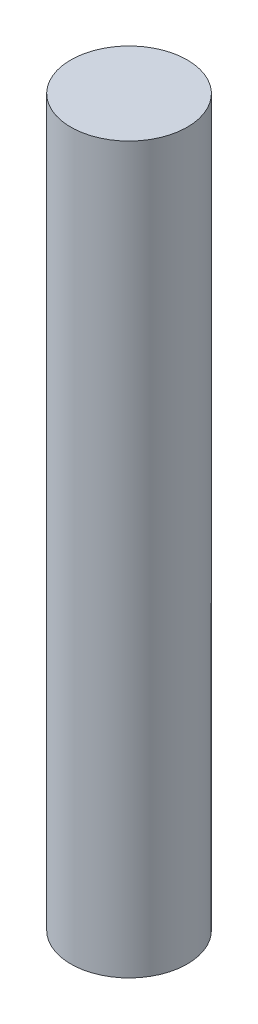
ISO-10303-21;
HEADER;
FILE_DESCRIPTION(('STEP AP214'),'2;1');
FILE_NAME('part.step','',(''),(''),'','','');
FILE_SCHEMA(('AUTOMOTIVE_DESIGN { 1 0 10303 214 1 1 1 1 }'));
ENDSEC;
DATA;
#1=APPLICATION_CONTEXT('core data for automotive mechanical design processes');
#2=APPLICATION_PROTOCOL_DEFINITION('international standard','automotive_design',2000,#1);
#3=PRODUCT_CONTEXT('',#1,'mechanical');
#4=PRODUCT('Part','Part','',(#3));
#5=PRODUCT_RELATED_PRODUCT_CATEGORY('part','',(#4));
#6=PRODUCT_DEFINITION_FORMATION('','',#4);
#7=PRODUCT_DEFINITION_CONTEXT('part definition',#1,'design');
#8=PRODUCT_DEFINITION('design','',#6,#7);
#9=PRODUCT_DEFINITION_SHAPE('','',#8);
#10=(LENGTH_UNIT() NAMED_UNIT(*) SI_UNIT(.MILLI.,.METRE.));
#11=(NAMED_UNIT(*) PLANE_ANGLE_UNIT() SI_UNIT($,.RADIAN.));
#12=(NAMED_UNIT(*) SI_UNIT($,.STERADIAN.) SOLID_ANGLE_UNIT());
#13=UNCERTAINTY_MEASURE_WITH_UNIT(LENGTH_MEASURE(1.E-05),#10,'distance_accuracy_value','');
#14=(GEOMETRIC_REPRESENTATION_CONTEXT(3) GLOBAL_UNCERTAINTY_ASSIGNED_CONTEXT((#13)) GLOBAL_UNIT_ASSIGNED_CONTEXT((#10,
#11,#12)) REPRESENTATION_CONTEXT('',''));
#15=CARTESIAN_POINT('',(0.,0.,0.));
#16=DIRECTION('',(0.,0.,1.));
#17=DIRECTION('',(1.,0.,0.));
#18=AXIS2_PLACEMENT_3D('',#15,#16,#17);
#19=CARTESIAN_POINT('',(0.,-125.082564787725,-139.));
#20=DIRECTION('',(0.,-1.,0.));
#21=DIRECTION('',(0.,0.,-1.));
#22=AXIS2_PLACEMENT_3D('',#19,#20,#21);
#23=PLANE('',#22);
#24=CARTESIAN_POINT('',(0.,-125.082564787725,-139.));
#25=DIRECTION('',(0.,-1.,0.));
#26=DIRECTION('',(0.,0.,-1.));
#27=AXIS2_PLACEMENT_3D('',#24,#25,#26);
#28=CIRCLE('',#27,2.);
#29=CARTESIAN_POINT('',(0.,-125.082564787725,-141.));
#30=VERTEX_POINT('',#29);
#31=EDGE_CURVE('E10',#30,#30,#28,.T.);
#32=ORIENTED_EDGE('',*,*,#31,.F.);
#33=EDGE_LOOP('',(#32));
#34=FACE_BOUND('',#33,.T.);
#35=ADVANCED_FACE('F352',(#34),#23,.F.);
#36=CARTESIAN_POINT('',(0.,-172.219437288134,-139.));
#37=DIRECTION('',(0.,-1.,0.));
#38=DIRECTION('',(0.,0.,-1.));
#39=AXIS2_PLACEMENT_3D('',#36,#37,#38);
#40=CYLINDRICAL_SURFACE('',#39,2.);
#41=CARTESIAN_POINT('',(0.,-149.963329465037,-139.));
#42=DIRECTION('',(0.,-1.,0.));
#43=DIRECTION('',(0.,0.,-1.));
#44=AXIS2_PLACEMENT_3D('',#41,#42,#43);
#45=CIRCLE('',#44,2.);
#46=CARTESIAN_POINT('',(0.,-149.963329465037,-141.));
#47=VERTEX_POINT('',#46);
#48=EDGE_CURVE('E358',#47,#47,#45,.T.);
#49=ORIENTED_EDGE('',*,*,#48,.F.);
#50=EDGE_LOOP('',(#49));
#51=FACE_BOUND('',#50,.T.);
#52=ORIENTED_EDGE('',*,*,#31,.T.);
#53=EDGE_LOOP('',(#52));
#54=FACE_BOUND('',#53,.T.);
#55=ADVANCED_FACE('F366',(#51,#54),#40,.T.);
#56=CARTESIAN_POINT('',(0.,-149.963329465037,-137.));
#57=DIRECTION('',(0.,1.,0.));
#58=DIRECTION('',(0.,0.,1.));
#59=AXIS2_PLACEMENT_3D('',#56,#57,#58);
#60=PLANE('',#59);
#61=ORIENTED_EDGE('',*,*,#48,.T.);
#62=EDGE_LOOP('',(#61));
#63=FACE_BOUND('',#62,.T.);
#64=ADVANCED_FACE('F364',(#63),#60,.F.);
#65=CLOSED_SHELL('',(#35,#55,#64));
#66=MANIFOLD_SOLID_BREP('B2',#65);
#67=ADVANCED_BREP_SHAPE_REPRESENTATION('',(#18,#66),#14);
#68=SHAPE_DEFINITION_REPRESENTATION(#9,#67);
ENDSEC;
END-ISO-10303-21;
